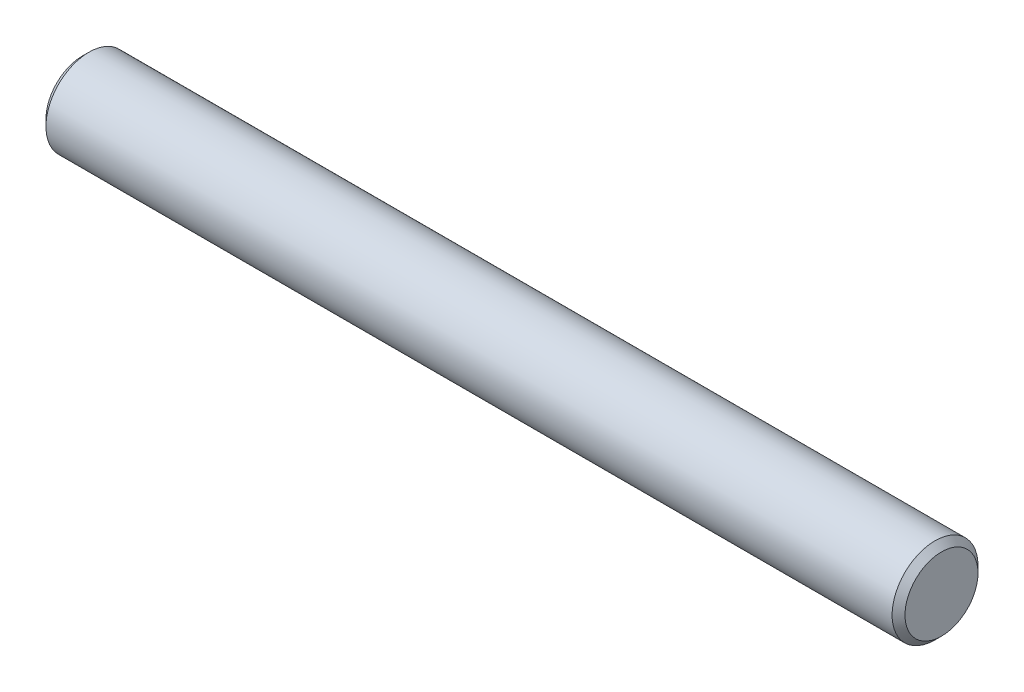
from build123d import *

# Parameters (mm, degrees)
ESQUISSE1_R        = 2
BOSS_EXTRU_1_DEPTH = 40
CHANFREIN1_SIZE    = 0.3


with BuildPart() as part:
    # Esquisse1 → Boss.-Extru.1 (new body)
    with BuildSketch(Plane(origin=(0, 0, 0), x_dir=(0, 0, -1), z_dir=(1, 0, 0))):
        Circle(ESQUISSE1_R)
    extrude(amount=BOSS_EXTRU_1_DEPTH)

    # Chanfrein1
    chanfrein1_edges = [part.edges().sort_by_distance(p)[0] for p in [
        (0, 0, 2),
        (40, 0, 2),
    ]]
    chamfer(chanfrein1_edges, length=CHANFREIN1_SIZE)


solid = part.part
